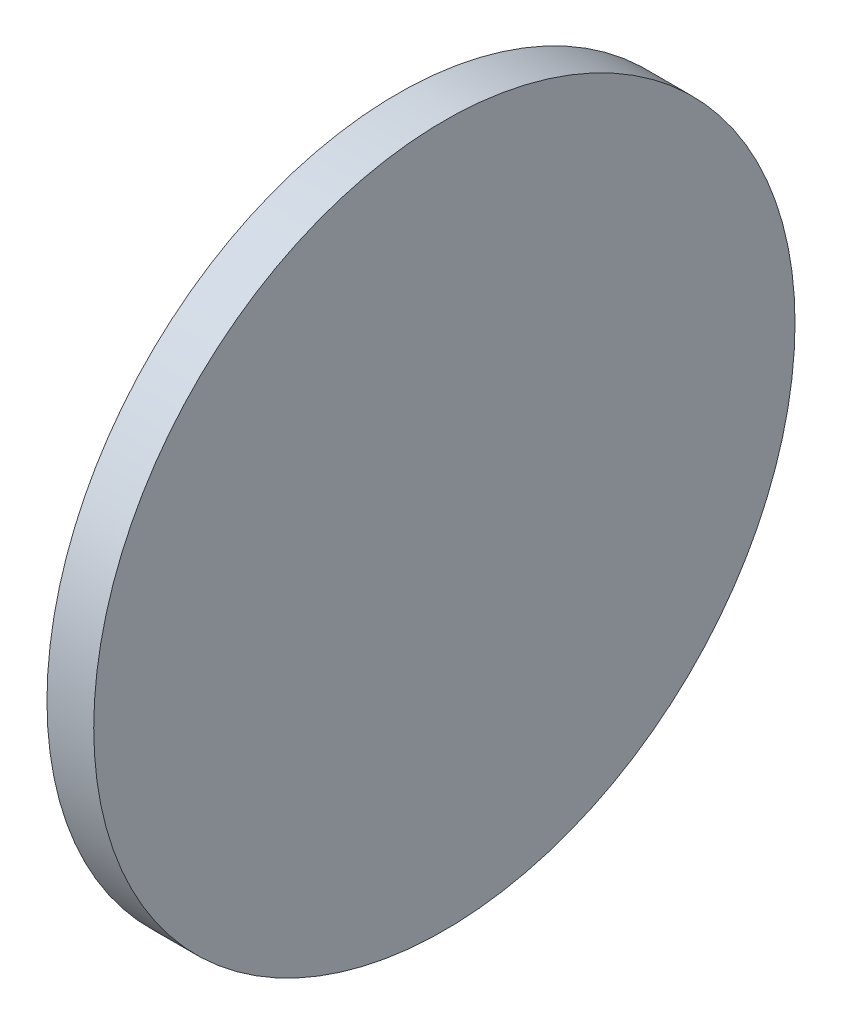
from build123d import *

# Parameters (mm, degrees)
BOSS_EXTRUDE1_START = 1
SKETCH1_R           = 9.525
BOSS_EXTRUDE1_DEPTH = 1.27


with BuildPart() as part:
    # Sketch1 → Boss-Extrude1 (new body)
    with BuildSketch(Plane(origin=(0, 0, 0), x_dir=(0, 0, -1), z_dir=(1, 0, 0)).offset(BOSS_EXTRUDE1_START)):
        Circle(SKETCH1_R)
    extrude(amount=BOSS_EXTRUDE1_DEPTH)


solid = part.part
